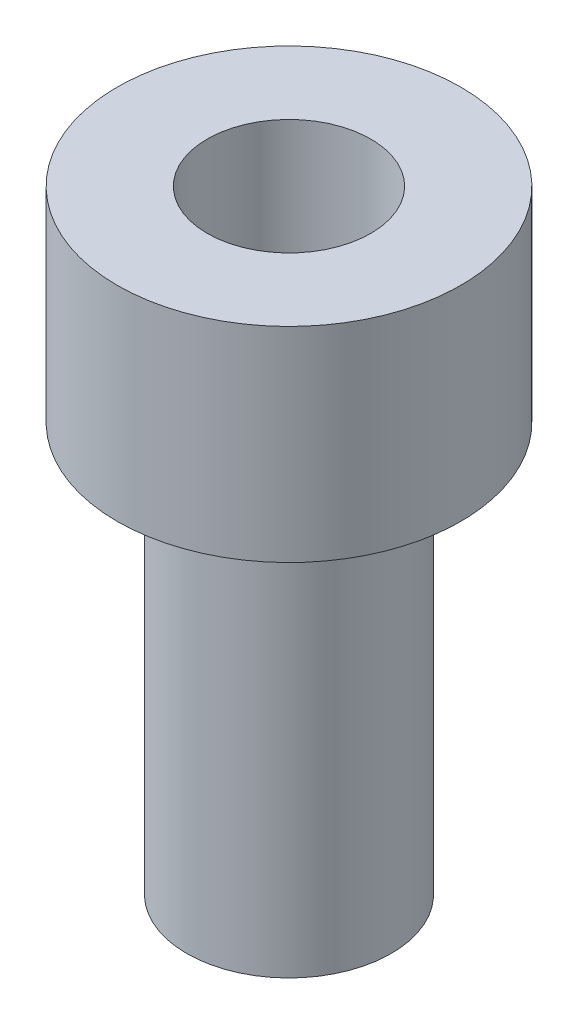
from build123d import *

# Parameters (mm, degrees)
SKETCH1_R           = 3.175
BASE_EXTRUDE_DEPTH  = 12.7
SKETCH2_R           = 5.334
BOSS_EXTRUDE1_DEPTH = 6.35
SKETCH3_R           = 2.54
CUT_EXTRUDE1_DEPTH  = 5.08


with BuildPart() as part:
    # Sketch1 → Base-Extrude (new body)
    with BuildSketch(Plane(origin=(0, 0, 0), x_dir=(1, 0, 0), z_dir=(0, 1, 0))):
        with Locations(Location((0, 0, 0), (0, 0, 270))):
            Circle(SKETCH1_R)
    extrude(amount=BASE_EXTRUDE_DEPTH)

    # Sketch2 → Boss-Extrude1 (add)
    with BuildSketch(Plane(origin=(0, 12.7, 0), x_dir=(-1, 0, 0), z_dir=(0, 1, 0))):
        with Locations(Location((0, 0, 0), (0, 0, 90))):
            Circle(SKETCH2_R)
    extrude(amount=BOSS_EXTRUDE1_DEPTH)

    # Sketch3 → Cut-Extrude1 (cut)
    with BuildSketch(Plane(origin=(0, 19.05, 0), x_dir=(-1, 0, 0), z_dir=(0, 1, 0))):
        with Locations(Location((0, 0, 0), (0, 0, 90))):
            Circle(SKETCH3_R)
    extrude(amount=-CUT_EXTRUDE1_DEPTH, mode=Mode.SUBTRACT)


solid = part.part
